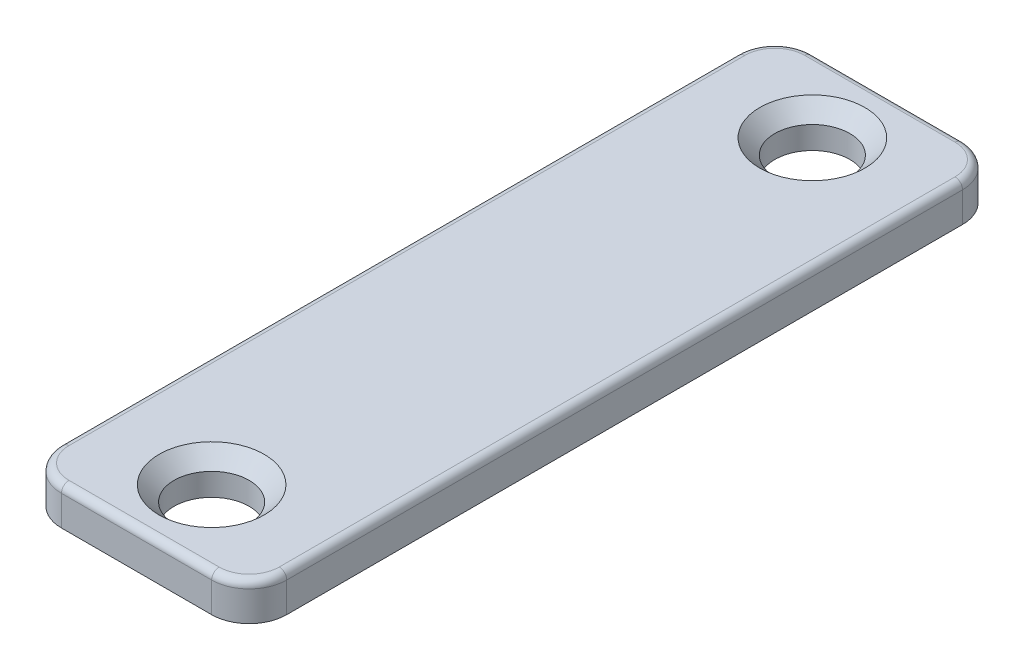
from build123d import *

# Parameters (mm, degrees)
SKETCH1_R           = 0.5
BOSS_EXTRUDE1_DEPTH = 0.5
FILLET1_R           = 0.1
CHAMFER1_SIZE       = 0.2


with BuildPart() as part:
    # Sketch1 → Boss-Extrude1 (new body)
    with BuildSketch(Plane(origin=(0, 0, 0), x_dir=(1, 0, 0), z_dir=(0, 1, 0))):
        with BuildLine():
            Line((1, -5), (-1, -5))
            ThreePointArc((-1, -5), (-1.353553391, -4.853553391), (-1.5, -4.5))
            Line((-1.5, -4.5), (-1.5, 4.5))
            ThreePointArc((-1.5, 4.5), (-1.353553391, 4.853553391), (-1, 5))
            Line((-1, 5), (1, 5))
            ThreePointArc((1, 5), (1.353553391, 4.853553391), (1.5, 4.5))
            Line((1.5, 4.5), (1.5, -4.5))
            ThreePointArc((1.5, -4.5), (1.353553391, -4.853553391), (1, -5))
        make_face()
        with Locations(Location((0, 4, 0), (0, 0, 270))):
            Circle(SKETCH1_R, mode=Mode.SUBTRACT)
        with Locations(Location((0, -4, 0), (0, 0, 270))):
            Circle(SKETCH1_R, mode=Mode.SUBTRACT)
    extrude(amount=BOSS_EXTRUDE1_DEPTH)

    # Fillet1
    fillet1_edges = [part.edges().sort_by_distance(p)[0] for p in [
        (1.353553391, 0.5, -4.853553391),
        (0, 0.5, -5),
        (-1.353553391, 0.5, -4.853553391),
        (-1.5, 0.5, 0),
        (-1.353553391, 0.5, 4.853553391),
        (0, 0.5, 5),
        (1.353553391, 0.5, 4.853553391),
        (1.5, 0.5, 0),
    ]]
    fillet(fillet1_edges, radius=FILLET1_R)

    # Chamfer1
    chamfer1_edges = [part.edges().sort_by_distance(p)[0] for p in [
        (0, 0.5, -4.5),
        (0, 0.5, 3.5),
    ]]
    chamfer(chamfer1_edges, length=CHAMFER1_SIZE)


solid = part.part
